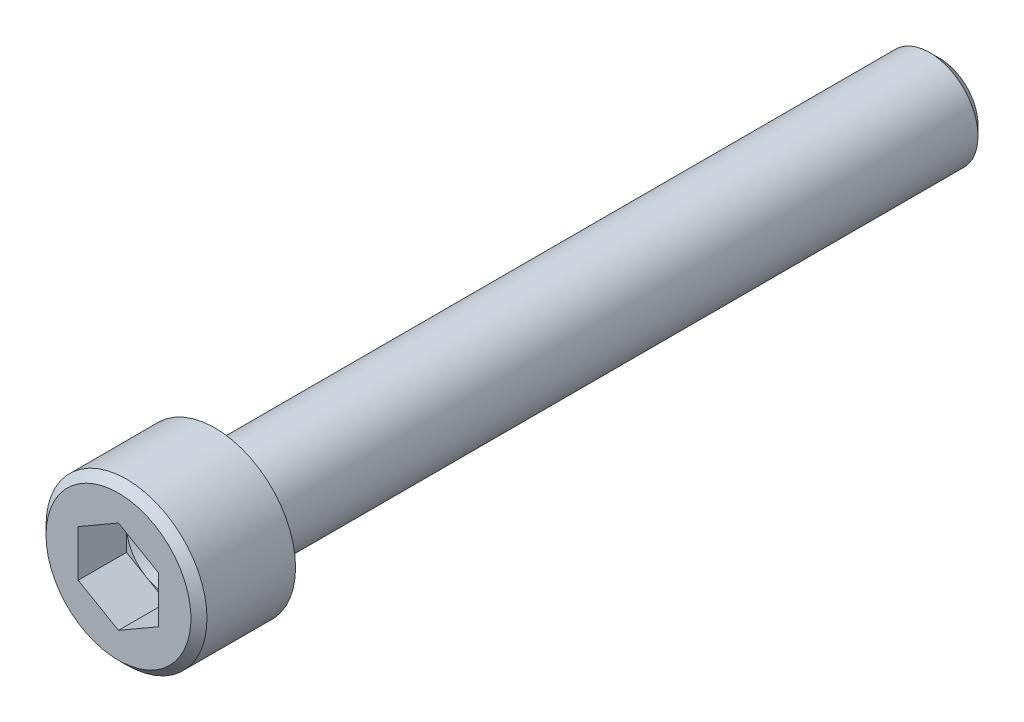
ISO-10303-21;
HEADER;
FILE_DESCRIPTION(('STEP AP214'),'2;1');
FILE_NAME('part.step','',(''),(''),'','','');
FILE_SCHEMA(('AUTOMOTIVE_DESIGN { 1 0 10303 214 1 1 1 1 }'));
ENDSEC;
DATA;
#1=APPLICATION_CONTEXT('core data for automotive mechanical design processes');
#2=APPLICATION_PROTOCOL_DEFINITION('international standard','automotive_design',2000,#1);
#3=PRODUCT_CONTEXT('',#1,'mechanical');
#4=PRODUCT('Part','Part','',(#3));
#5=PRODUCT_RELATED_PRODUCT_CATEGORY('part','',(#4));
#6=PRODUCT_DEFINITION_FORMATION('','',#4);
#7=PRODUCT_DEFINITION_CONTEXT('part definition',#1,'design');
#8=PRODUCT_DEFINITION('design','',#6,#7);
#9=PRODUCT_DEFINITION_SHAPE('','',#8);
#10=(LENGTH_UNIT() NAMED_UNIT(*) SI_UNIT(.MILLI.,.METRE.));
#11=(NAMED_UNIT(*) PLANE_ANGLE_UNIT() SI_UNIT($,.RADIAN.));
#12=(NAMED_UNIT(*) SI_UNIT($,.STERADIAN.) SOLID_ANGLE_UNIT());
#13=UNCERTAINTY_MEASURE_WITH_UNIT(LENGTH_MEASURE(1.E-05),#10,'distance_accuracy_value','');
#14=(GEOMETRIC_REPRESENTATION_CONTEXT(3) GLOBAL_UNCERTAINTY_ASSIGNED_CONTEXT((#13)) GLOBAL_UNIT_ASSIGNED_CONTEXT((#10,
#11,#12)) REPRESENTATION_CONTEXT('',''));
#15=CARTESIAN_POINT('',(0.,0.,0.));
#16=DIRECTION('',(0.,0.,1.));
#17=DIRECTION('',(1.,0.,0.));
#18=AXIS2_PLACEMENT_3D('',#15,#16,#17);
#19=CARTESIAN_POINT('',(0.,0.,3.));
#20=DIRECTION('',(0.,0.,1.));
#21=DIRECTION('',(1.,0.,0.));
#22=AXIS2_PLACEMENT_3D('',#19,#20,#21);
#23=PLANE('',#22);
#24=CARTESIAN_POINT('',(0.,0.,2.99999999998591));
#25=DIRECTION('',(0.,0.,1.));
#26=DIRECTION('',(1.,0.,0.));
#27=AXIS2_PLACEMENT_3D('',#24,#25,#26);
#28=CIRCLE('',#27,2.49999999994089);
#29=CARTESIAN_POINT('',(2.49999999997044,0.,2.99999999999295));
#30=VERTEX_POINT('',#29);
#31=CARTESIAN_POINT('',(1.24999999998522,-2.1650635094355,2.99999999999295));
#32=VERTEX_POINT('',#31);
#33=EDGE_CURVE('E19',#30,#32,#28,.F.);
#34=ORIENTED_EDGE('',*,*,#33,.T.);
#35=DIRECTION('',(0.866025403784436,0.5,0.));
#36=VECTOR('',#35,1.);
#37=CARTESIAN_POINT('',(1.25,-2.1650635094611,3.));
#38=LINE('',#37,#36);
#39=CARTESIAN_POINT('',(2.5,-1.44337567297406,3.));
#40=VERTEX_POINT('',#39);
#41=EDGE_CURVE('E92',#32,#40,#38,.T.);
#42=ORIENTED_EDGE('',*,*,#41,.T.);
#43=DIRECTION('',(0.,1.,0.));
#44=VECTOR('',#43,1.);
#45=CARTESIAN_POINT('',(2.5,0.,3.));
#46=LINE('',#45,#44);
#47=EDGE_CURVE('E88',#40,#30,#46,.T.);
#48=ORIENTED_EDGE('',*,*,#47,.T.);
#49=EDGE_LOOP('',(#34,#42,#48));
#50=FACE_BOUND('',#49,.T.);
#51=ADVANCED_FACE('F16',(#50),#23,.T.);
#52=CARTESIAN_POINT('',(0.,0.,3.));
#53=DIRECTION('',(0.,0.,1.));
#54=DIRECTION('',(1.,0.,0.));
#55=AXIS2_PLACEMENT_3D('',#52,#53,#54);
#56=PLANE('',#55);
#57=CARTESIAN_POINT('',(0.,0.,2.99999999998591));
#58=DIRECTION('',(0.,0.,1.));
#59=DIRECTION('',(1.,0.,0.));
#60=AXIS2_PLACEMENT_3D('',#57,#58,#59);
#61=CIRCLE('',#60,2.49999999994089);
#62=CARTESIAN_POINT('',(-1.24999999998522,-2.1650635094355,2.99999999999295));
#63=VERTEX_POINT('',#62);
#64=EDGE_CURVE('E107',#32,#63,#61,.F.);
#65=ORIENTED_EDGE('',*,*,#64,.T.);
#66=DIRECTION('',(0.866025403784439,-0.5,0.));
#67=VECTOR('',#66,1.);
#68=CARTESIAN_POINT('',(-1.25,-2.1650635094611,3.));
#69=LINE('',#68,#67);
#70=CARTESIAN_POINT('',(0.,-2.88675134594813,3.));
#71=VERTEX_POINT('',#70);
#72=EDGE_CURVE('E157',#63,#71,#69,.T.);
#73=ORIENTED_EDGE('',*,*,#72,.T.);
#74=DIRECTION('',(0.866025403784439,0.5,0.));
#75=VECTOR('',#74,1.);
#76=CARTESIAN_POINT('',(0.,-2.88675134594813,3.));
#77=LINE('',#76,#75);
#78=EDGE_CURVE('E162',#71,#32,#77,.T.);
#79=ORIENTED_EDGE('',*,*,#78,.T.);
#80=EDGE_LOOP('',(#65,#73,#79));
#81=FACE_BOUND('',#80,.T.);
#82=ADVANCED_FACE('F216',(#81),#56,.T.);
#83=CARTESIAN_POINT('',(0.,0.,3.));
#84=DIRECTION('',(0.,0.,1.));
#85=DIRECTION('',(1.,0.,0.));
#86=AXIS2_PLACEMENT_3D('',#83,#84,#85);
#87=PLANE('',#86);
#88=CARTESIAN_POINT('',(0.,0.,2.99999999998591));
#89=DIRECTION('',(0.,0.,1.));
#90=DIRECTION('',(1.,0.,0.));
#91=AXIS2_PLACEMENT_3D('',#88,#89,#90);
#92=CIRCLE('',#91,2.49999999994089);
#93=CARTESIAN_POINT('',(-2.49999999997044,0.,2.99999999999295));
#94=VERTEX_POINT('',#93);
#95=EDGE_CURVE('E213',#63,#94,#92,.F.);
#96=ORIENTED_EDGE('',*,*,#95,.T.);
#97=DIRECTION('',(0.,1.,0.));
#98=VECTOR('',#97,1.);
#99=CARTESIAN_POINT('',(-2.5,0.,3.));
#100=LINE('',#99,#98);
#101=CARTESIAN_POINT('',(-2.5,-1.44337567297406,3.));
#102=VERTEX_POINT('',#101);
#103=EDGE_CURVE('E147',#94,#102,#100,.F.);
#104=ORIENTED_EDGE('',*,*,#103,.T.);
#105=DIRECTION('',(0.866025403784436,-0.5,0.));
#106=VECTOR('',#105,1.);
#107=CARTESIAN_POINT('',(-2.5,-1.44337567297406,3.));
#108=LINE('',#107,#106);
#109=EDGE_CURVE('E152',#102,#63,#108,.T.);
#110=ORIENTED_EDGE('',*,*,#109,.T.);
#111=EDGE_LOOP('',(#96,#104,#110));
#112=FACE_BOUND('',#111,.T.);
#113=ADVANCED_FACE('F218',(#112),#87,.T.);
#114=CARTESIAN_POINT('',(0.,0.,3.));
#115=DIRECTION('',(0.,0.,1.));
#116=DIRECTION('',(1.,0.,0.));
#117=AXIS2_PLACEMENT_3D('',#114,#115,#116);
#118=PLANE('',#117);
#119=CARTESIAN_POINT('',(0.,0.,2.99999999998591));
#120=DIRECTION('',(0.,0.,1.));
#121=DIRECTION('',(1.,0.,0.));
#122=AXIS2_PLACEMENT_3D('',#119,#120,#121);
#123=CIRCLE('',#122,2.49999999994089);
#124=CARTESIAN_POINT('',(-1.24999999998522,2.1650635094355,2.99999999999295));
#125=VERTEX_POINT('',#124);
#126=EDGE_CURVE('E210',#94,#125,#123,.F.);
#127=ORIENTED_EDGE('',*,*,#126,.T.);
#128=DIRECTION('',(-0.866025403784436,-0.5,0.));
#129=VECTOR('',#128,1.);
#130=CARTESIAN_POINT('',(-1.25,2.1650635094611,3.));
#131=LINE('',#130,#129);
#132=CARTESIAN_POINT('',(-2.5,1.44337567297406,3.));
#133=VERTEX_POINT('',#132);
#134=EDGE_CURVE('E137',#125,#133,#131,.T.);
#135=ORIENTED_EDGE('',*,*,#134,.T.);
#136=DIRECTION('',(0.,1.,0.));
#137=VECTOR('',#136,1.);
#138=CARTESIAN_POINT('',(-2.5,0.,3.));
#139=LINE('',#138,#137);
#140=EDGE_CURVE('E142',#133,#94,#139,.F.);
#141=ORIENTED_EDGE('',*,*,#140,.T.);
#142=EDGE_LOOP('',(#127,#135,#141));
#143=FACE_BOUND('',#142,.T.);
#144=ADVANCED_FACE('F221',(#143),#118,.T.);
#145=CARTESIAN_POINT('',(0.,0.,3.));
#146=DIRECTION('',(0.,0.,1.));
#147=DIRECTION('',(1.,0.,0.));
#148=AXIS2_PLACEMENT_3D('',#145,#146,#147);
#149=PLANE('',#148);
#150=CARTESIAN_POINT('',(0.,0.,2.99999999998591));
#151=DIRECTION('',(0.,0.,1.));
#152=DIRECTION('',(1.,0.,0.));
#153=AXIS2_PLACEMENT_3D('',#150,#151,#152);
#154=CIRCLE('',#153,2.49999999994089);
#155=CARTESIAN_POINT('',(1.24999999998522,2.1650635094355,2.99999999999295));
#156=VERTEX_POINT('',#155);
#157=EDGE_CURVE('E207',#125,#156,#154,.F.);
#158=ORIENTED_EDGE('',*,*,#157,.T.);
#159=DIRECTION('',(-0.866025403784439,0.5,0.));
#160=VECTOR('',#159,1.);
#161=CARTESIAN_POINT('',(1.25,2.1650635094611,3.));
#162=LINE('',#161,#160);
#163=CARTESIAN_POINT('',(0.,2.88675134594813,3.));
#164=VERTEX_POINT('',#163);
#165=EDGE_CURVE('E108',#156,#164,#162,.T.);
#166=ORIENTED_EDGE('',*,*,#165,.T.);
#167=DIRECTION('',(-0.866025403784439,-0.5,0.));
#168=VECTOR('',#167,1.);
#169=CARTESIAN_POINT('',(0.,2.88675134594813,3.));
#170=LINE('',#169,#168);
#171=EDGE_CURVE('E132',#164,#125,#170,.T.);
#172=ORIENTED_EDGE('',*,*,#171,.T.);
#173=EDGE_LOOP('',(#158,#166,#172));
#174=FACE_BOUND('',#173,.T.);
#175=ADVANCED_FACE('F223',(#174),#149,.T.);
#176=CARTESIAN_POINT('',(0.,0.,2.99999999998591));
#177=DIRECTION('',(0.,0.,1.));
#178=DIRECTION('',(1.,0.,0.));
#179=AXIS2_PLACEMENT_3D('',#176,#177,#178);
#180=CONICAL_SURFACE('',#179,2.49999999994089,1.04719755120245);
#181=CARTESIAN_POINT('',(0.,0.,1.55662432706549));
#182=VERTEX_POINT('',#181);
#183=VERTEX_LOOP('',#182);
#184=FACE_BOUND('',#183,.T.);
#185=ORIENTED_EDGE('',*,*,#157,.F.);
#186=ORIENTED_EDGE('',*,*,#126,.F.);
#187=ORIENTED_EDGE('',*,*,#95,.F.);
#188=ORIENTED_EDGE('',*,*,#64,.F.);
#189=ORIENTED_EDGE('',*,*,#33,.F.);
#190=CARTESIAN_POINT('',(0.,0.,2.99999999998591));
#191=DIRECTION('',(0.,0.,1.));
#192=DIRECTION('',(1.,0.,0.));
#193=AXIS2_PLACEMENT_3D('',#190,#191,#192);
#194=CIRCLE('',#193,2.49999999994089);
#195=EDGE_CURVE('E103',#156,#30,#194,.F.);
#196=ORIENTED_EDGE('',*,*,#195,.F.);
#197=EDGE_LOOP('',(#185,#186,#187,#188,#189,#196));
#198=FACE_BOUND('',#197,.T.);
#199=ADVANCED_FACE('F102',(#184,#198),#180,.F.);
#200=CARTESIAN_POINT('',(0.,0.,3.));
#201=DIRECTION('',(0.,0.,1.));
#202=DIRECTION('',(1.,0.,0.));
#203=AXIS2_PLACEMENT_3D('',#200,#201,#202);
#204=PLANE('',#203);
#205=ORIENTED_EDGE('',*,*,#195,.T.);
#206=DIRECTION('',(0.,1.,0.));
#207=VECTOR('',#206,1.);
#208=CARTESIAN_POINT('',(2.5,-1.44337567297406,3.));
#209=LINE('',#208,#207);
#210=CARTESIAN_POINT('',(2.5,1.44337567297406,3.));
#211=VERTEX_POINT('',#210);
#212=EDGE_CURVE('E112',#30,#211,#209,.T.);
#213=ORIENTED_EDGE('',*,*,#212,.T.);
#214=DIRECTION('',(-0.866025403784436,0.5,0.));
#215=VECTOR('',#214,1.);
#216=CARTESIAN_POINT('',(2.5,1.44337567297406,3.));
#217=LINE('',#216,#215);
#218=EDGE_CURVE('E114',#211,#156,#217,.T.);
#219=ORIENTED_EDGE('',*,*,#218,.T.);
#220=EDGE_LOOP('',(#205,#213,#219));
#221=FACE_BOUND('',#220,.T.);
#222=ADVANCED_FACE('F111',(#221),#204,.T.);
#223=CARTESIAN_POINT('',(2.5,-1.44337567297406,3.));
#224=DIRECTION('',(1.,0.,0.));
#225=DIRECTION('',(0.,0.,-1.));
#226=AXIS2_PLACEMENT_3D('',#223,#224,#225);
#227=PLANE('',#226);
#228=DIRECTION('',(0.,0.,1.));
#229=VECTOR('',#228,1.);
#230=CARTESIAN_POINT('',(2.5,1.44337567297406,3.));
#231=LINE('',#230,#229);
#232=CARTESIAN_POINT('',(2.5,1.44337567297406,6.));
#233=VERTEX_POINT('',#232);
#234=EDGE_CURVE('E118',#233,#211,#231,.F.);
#235=ORIENTED_EDGE('',*,*,#234,.T.);
#236=ORIENTED_EDGE('',*,*,#212,.F.);
#237=ORIENTED_EDGE('',*,*,#47,.F.);
#238=DIRECTION('',(0.,0.,1.));
#239=VECTOR('',#238,1.);
#240=CARTESIAN_POINT('',(2.5,-1.44337567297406,3.));
#241=LINE('',#240,#239);
#242=CARTESIAN_POINT('',(2.5,-1.44337567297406,6.));
#243=VERTEX_POINT('',#242);
#244=EDGE_CURVE('E189',#40,#243,#241,.T.);
#245=ORIENTED_EDGE('',*,*,#244,.T.);
#246=DIRECTION('',(0.,1.,0.));
#247=VECTOR('',#246,1.);
#248=CARTESIAN_POINT('',(2.5,0.,6.));
#249=LINE('',#248,#247);
#250=EDGE_CURVE('E193',#243,#233,#249,.T.);
#251=ORIENTED_EDGE('',*,*,#250,.T.);
#252=EDGE_LOOP('',(#235,#236,#237,#245,#251));
#253=FACE_BOUND('',#252,.T.);
#254=ADVANCED_FACE('F116',(#253),#227,.F.);
#255=CARTESIAN_POINT('',(2.5,1.44337567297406,3.));
#256=DIRECTION('',(0.5,0.866025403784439,0.));
#257=DIRECTION('',(-0.866025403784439,0.5,0.));
#258=AXIS2_PLACEMENT_3D('',#255,#256,#257);
#259=PLANE('',#258);
#260=DIRECTION('',(0.,0.,1.));
#261=VECTOR('',#260,1.);
#262=CARTESIAN_POINT('',(0.,2.88675134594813,3.));
#263=LINE('',#262,#261);
#264=CARTESIAN_POINT('',(0.,2.88675134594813,6.));
#265=VERTEX_POINT('',#264);
#266=EDGE_CURVE('E120',#265,#164,#263,.F.);
#267=ORIENTED_EDGE('',*,*,#266,.T.);
#268=ORIENTED_EDGE('',*,*,#165,.F.);
#269=ORIENTED_EDGE('',*,*,#218,.F.);
#270=ORIENTED_EDGE('',*,*,#234,.F.);
#271=DIRECTION('',(-0.866025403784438,0.5,0.));
#272=VECTOR('',#271,1.);
#273=CARTESIAN_POINT('',(2.5,1.44337567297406,6.));
#274=LINE('',#273,#272);
#275=EDGE_CURVE('E231',#233,#265,#274,.T.);
#276=ORIENTED_EDGE('',*,*,#275,.T.);
#277=EDGE_LOOP('',(#267,#268,#269,#270,#276));
#278=FACE_BOUND('',#277,.T.);
#279=ADVANCED_FACE('F229',(#278),#259,.F.);
#280=CARTESIAN_POINT('',(0.,2.88675134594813,3.));
#281=DIRECTION('',(-0.5,0.866025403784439,0.));
#282=DIRECTION('',(-0.866025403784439,-0.5,0.));
#283=AXIS2_PLACEMENT_3D('',#280,#281,#282);
#284=PLANE('',#283);
#285=DIRECTION('',(0.,0.,1.));
#286=VECTOR('',#285,1.);
#287=CARTESIAN_POINT('',(-2.5,1.44337567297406,3.));
#288=LINE('',#287,#286);
#289=CARTESIAN_POINT('',(-2.5,1.44337567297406,6.));
#290=VERTEX_POINT('',#289);
#291=EDGE_CURVE('E175',#290,#133,#288,.F.);
#292=ORIENTED_EDGE('',*,*,#291,.T.);
#293=ORIENTED_EDGE('',*,*,#134,.F.);
#294=ORIENTED_EDGE('',*,*,#171,.F.);
#295=ORIENTED_EDGE('',*,*,#266,.F.);
#296=DIRECTION('',(-0.866025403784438,-0.5,0.));
#297=VECTOR('',#296,1.);
#298=CARTESIAN_POINT('',(0.,2.88675134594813,6.));
#299=LINE('',#298,#297);
#300=EDGE_CURVE('E234',#265,#290,#299,.T.);
#301=ORIENTED_EDGE('',*,*,#300,.T.);
#302=EDGE_LOOP('',(#292,#293,#294,#295,#301));
#303=FACE_BOUND('',#302,.T.);
#304=ADVANCED_FACE('F226',(#303),#284,.F.);
#305=CARTESIAN_POINT('',(-2.5,1.44337567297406,3.));
#306=DIRECTION('',(-1.,0.,0.));
#307=DIRECTION('',(0.,0.,1.));
#308=AXIS2_PLACEMENT_3D('',#305,#306,#307);
#309=PLANE('',#308);
#310=DIRECTION('',(0.,0.,1.));
#311=VECTOR('',#310,1.);
#312=CARTESIAN_POINT('',(-2.5,-1.44337567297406,3.));
#313=LINE('',#312,#311);
#314=CARTESIAN_POINT('',(-2.5,-1.44337567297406,6.));
#315=VERTEX_POINT('',#314);
#316=EDGE_CURVE('E180',#315,#102,#313,.F.);
#317=ORIENTED_EDGE('',*,*,#316,.T.);
#318=ORIENTED_EDGE('',*,*,#103,.F.);
#319=ORIENTED_EDGE('',*,*,#140,.F.);
#320=ORIENTED_EDGE('',*,*,#291,.F.);
#321=DIRECTION('',(0.,1.,0.));
#322=VECTOR('',#321,1.);
#323=CARTESIAN_POINT('',(-2.5,0.,6.));
#324=LINE('',#323,#322);
#325=EDGE_CURVE('E236',#290,#315,#324,.F.);
#326=ORIENTED_EDGE('',*,*,#325,.T.);
#327=EDGE_LOOP('',(#317,#318,#319,#320,#326));
#328=FACE_BOUND('',#327,.T.);
#329=ADVANCED_FACE('F349',(#328),#309,.F.);
#330=CARTESIAN_POINT('',(-2.5,-1.44337567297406,3.));
#331=DIRECTION('',(-0.5,-0.866025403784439,0.));
#332=DIRECTION('',(0.866025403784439,-0.5,0.));
#333=AXIS2_PLACEMENT_3D('',#330,#331,#332);
#334=PLANE('',#333);
#335=DIRECTION('',(0.,0.,1.));
#336=VECTOR('',#335,1.);
#337=CARTESIAN_POINT('',(0.,-2.88675134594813,3.));
#338=LINE('',#337,#336);
#339=CARTESIAN_POINT('',(0.,-2.88675134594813,6.));
#340=VERTEX_POINT('',#339);
#341=EDGE_CURVE('E185',#340,#71,#338,.F.);
#342=ORIENTED_EDGE('',*,*,#341,.T.);
#343=ORIENTED_EDGE('',*,*,#72,.F.);
#344=ORIENTED_EDGE('',*,*,#109,.F.);
#345=ORIENTED_EDGE('',*,*,#316,.F.);
#346=DIRECTION('',(0.866025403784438,-0.5,0.));
#347=VECTOR('',#346,1.);
#348=CARTESIAN_POINT('',(-2.5,-1.44337567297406,6.));
#349=LINE('',#348,#347);
#350=EDGE_CURVE('E34',#315,#340,#349,.T.);
#351=ORIENTED_EDGE('',*,*,#350,.T.);
#352=EDGE_LOOP('',(#342,#343,#344,#345,#351));
#353=FACE_BOUND('',#352,.T.);
#354=ADVANCED_FACE('F340',(#353),#334,.F.);
#355=CARTESIAN_POINT('',(0.,-2.88675134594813,3.));
#356=DIRECTION('',(0.5,-0.866025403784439,0.));
#357=DIRECTION('',(0.866025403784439,0.5,0.));
#358=AXIS2_PLACEMENT_3D('',#355,#356,#357);
#359=PLANE('',#358);
#360=ORIENTED_EDGE('',*,*,#244,.F.);
#361=ORIENTED_EDGE('',*,*,#41,.F.);
#362=ORIENTED_EDGE('',*,*,#78,.F.);
#363=ORIENTED_EDGE('',*,*,#341,.F.);
#364=DIRECTION('',(0.866025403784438,0.5,0.));
#365=VECTOR('',#364,1.);
#366=CARTESIAN_POINT('',(0.,-2.88675134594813,6.));
#367=LINE('',#366,#365);
#368=EDGE_CURVE('E205',#340,#243,#367,.T.);
#369=ORIENTED_EDGE('',*,*,#368,.T.);
#370=EDGE_LOOP('',(#360,#361,#362,#363,#369));
#371=FACE_BOUND('',#370,.T.);
#372=ADVANCED_FACE('F333',(#371),#359,.F.);
#373=CARTESIAN_POINT('',(0.,0.,6.));
#374=DIRECTION('',(0.,0.,-1.));
#375=DIRECTION('',(-1.,0.,0.));
#376=AXIS2_PLACEMENT_3D('',#373,#374,#375);
#377=PLANE('',#376);
#378=ORIENTED_EDGE('',*,*,#350,.F.);
#379=ORIENTED_EDGE('',*,*,#325,.F.);
#380=ORIENTED_EDGE('',*,*,#300,.F.);
#381=ORIENTED_EDGE('',*,*,#275,.F.);
#382=ORIENTED_EDGE('',*,*,#250,.F.);
#383=ORIENTED_EDGE('',*,*,#368,.F.);
#384=EDGE_LOOP('',(#378,#379,#380,#381,#382,#383));
#385=FACE_BOUND('',#384,.T.);
#386=CARTESIAN_POINT('',(0.,0.,5.99999999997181));
#387=DIRECTION('',(0.,0.,-1.));
#388=DIRECTION('',(-1.,0.,0.));
#389=AXIS2_PLACEMENT_3D('',#386,#387,#388);
#390=CIRCLE('',#389,4.49999999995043);
#391=CARTESIAN_POINT('',(-4.49999999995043,0.,5.99999999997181));
#392=VERTEX_POINT('',#391);
#393=EDGE_CURVE('E203',#392,#392,#390,.T.);
#394=ORIENTED_EDGE('',*,*,#393,.F.);
#395=EDGE_LOOP('',(#394));
#396=FACE_BOUND('',#395,.T.);
#397=ADVANCED_FACE('F275',(#385,#396),#377,.F.);
#398=CARTESIAN_POINT('',(0.,0.,5.49999999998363));
#399=DIRECTION('',(0.,0.,-1.));
#400=DIRECTION('',(-1.,0.,0.));
#401=AXIS2_PLACEMENT_3D('',#398,#399,#400);
#402=CONICAL_SURFACE('',#401,4.99999999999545,0.785398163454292);
#403=ORIENTED_EDGE('',*,*,#393,.T.);
#404=EDGE_LOOP('',(#403));
#405=FACE_BOUND('',#404,.T.);
#406=CARTESIAN_POINT('',(0.,0.,5.5));
#407=DIRECTION('',(0.,0.,1.));
#408=DIRECTION('',(1.,0.,0.));
#409=AXIS2_PLACEMENT_3D('',#406,#407,#408);
#410=CIRCLE('',#409,5.);
#411=CARTESIAN_POINT('',(5.,0.,5.5));
#412=VERTEX_POINT('',#411);
#413=EDGE_CURVE('E202',#412,#412,#410,.F.);
#414=ORIENTED_EDGE('',*,*,#413,.F.);
#415=EDGE_LOOP('',(#414));
#416=FACE_BOUND('',#415,.T.);
#417=ADVANCED_FACE('F265',(#405,#416),#402,.T.);
#418=CARTESIAN_POINT('',(0.,2.3865,-45.));
#419=DIRECTION('',(0.,0.,1.));
#420=DIRECTION('',(1.,0.,0.));
#421=AXIS2_PLACEMENT_3D('',#418,#419,#420);
#422=PLANE('',#421);
#423=CARTESIAN_POINT('',(0.,0.,-44.9999999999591));
#424=DIRECTION('',(0.,0.,1.));
#425=DIRECTION('',(1.,0.,0.));
#426=AXIS2_PLACEMENT_3D('',#423,#424,#425);
#427=CIRCLE('',#426,2.38650000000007);
#428=CARTESIAN_POINT('',(2.38650000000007,0.,-44.9999999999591));
#429=VERTEX_POINT('',#428);
#430=EDGE_CURVE('E199',#429,#429,#427,.T.);
#431=ORIENTED_EDGE('',*,*,#430,.F.);
#432=EDGE_LOOP('',(#431));
#433=FACE_BOUND('',#432,.T.);
#434=ADVANCED_FACE('F263',(#433),#422,.F.);
#435=CARTESIAN_POINT('',(0.,0.,0.));
#436=DIRECTION('',(0.,0.,1.));
#437=DIRECTION('',(1.,0.,0.));
#438=AXIS2_PLACEMENT_3D('',#435,#436,#437);
#439=CYLINDRICAL_SURFACE('',#438,5.);
#440=ORIENTED_EDGE('',*,*,#413,.T.);
#441=EDGE_LOOP('',(#440));
#442=FACE_BOUND('',#441,.T.);
#443=CARTESIAN_POINT('',(0.,0.,0.));
#444=DIRECTION('',(0.,0.,1.));
#445=DIRECTION('',(1.,0.,0.));
#446=AXIS2_PLACEMENT_3D('',#443,#444,#445);
#447=CIRCLE('',#446,5.);
#448=CARTESIAN_POINT('',(5.,0.,0.));
#449=VERTEX_POINT('',#448);
#450=EDGE_CURVE('E196',#449,#449,#447,.T.);
#451=ORIENTED_EDGE('',*,*,#450,.T.);
#452=EDGE_LOOP('',(#451));
#453=FACE_BOUND('',#452,.T.);
#454=ADVANCED_FACE('F259',(#442,#453),#439,.T.);
#455=CARTESIAN_POINT('',(0.,0.,-44.386500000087));
#456=DIRECTION('',(0.,0.,1.));
#457=DIRECTION('',(1.,0.,0.));
#458=AXIS2_PLACEMENT_3D('',#455,#456,#457);
#459=CONICAL_SURFACE('',#458,2.99999999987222,0.785398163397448);
#460=CARTESIAN_POINT('',(0.,0.,-44.3865));
#461=DIRECTION('',(0.,0.,1.));
#462=DIRECTION('',(1.,0.,0.));
#463=AXIS2_PLACEMENT_3D('',#460,#461,#462);
#464=CIRCLE('',#463,3.);
#465=CARTESIAN_POINT('',(3.,0.,-44.3865));
#466=VERTEX_POINT('',#465);
#467=EDGE_CURVE('E25',#466,#466,#464,.T.);
#468=ORIENTED_EDGE('',*,*,#467,.F.);
#469=EDGE_LOOP('',(#468));
#470=FACE_BOUND('',#469,.T.);
#471=ORIENTED_EDGE('',*,*,#430,.T.);
#472=EDGE_LOOP('',(#471));
#473=FACE_BOUND('',#472,.T.);
#474=ADVANCED_FACE('F255',(#470,#473),#459,.T.);
#475=CARTESIAN_POINT('',(0.,5.,0.));
#476=DIRECTION('',(0.,0.,1.));
#477=DIRECTION('',(1.,0.,0.));
#478=AXIS2_PLACEMENT_3D('',#475,#476,#477);
#479=PLANE('',#478);
#480=ORIENTED_EDGE('',*,*,#450,.F.);
#481=EDGE_LOOP('',(#480));
#482=FACE_BOUND('',#481,.T.);
#483=CARTESIAN_POINT('',(0.,0.,0.));
#484=DIRECTION('',(0.,0.,1.));
#485=DIRECTION('',(1.,0.,0.));
#486=AXIS2_PLACEMENT_3D('',#483,#484,#485);
#487=CIRCLE('',#486,3.);
#488=CARTESIAN_POINT('',(3.,0.,0.));
#489=VERTEX_POINT('',#488);
#490=EDGE_CURVE('E11',#489,#489,#487,.F.);
#491=ORIENTED_EDGE('',*,*,#490,.F.);
#492=EDGE_LOOP('',(#491));
#493=FACE_BOUND('',#492,.T.);
#494=ADVANCED_FACE('F258',(#482,#493),#479,.F.);
#495=CARTESIAN_POINT('',(0.,0.,-45.));
#496=DIRECTION('',(0.,0.,1.));
#497=DIRECTION('',(1.,0.,0.));
#498=AXIS2_PLACEMENT_3D('',#495,#496,#497);
#499=CYLINDRICAL_SURFACE('',#498,3.);
#500=ORIENTED_EDGE('',*,*,#490,.T.);
#501=EDGE_LOOP('',(#500));
#502=FACE_BOUND('',#501,.T.);
#503=ORIENTED_EDGE('',*,*,#467,.T.);
#504=EDGE_LOOP('',(#503));
#505=FACE_BOUND('',#504,.T.);
#506=ADVANCED_FACE('F253',(#502,#505),#499,.T.);
#507=CLOSED_SHELL('',(#51,#82,#113,#144,#175,#199,#222,#254,#279,#304,#329,#354,#372,#397,#417,
#434,#454,#474,#494,#506));
#508=MANIFOLD_SOLID_BREP('B1',#507);
#509=ADVANCED_BREP_SHAPE_REPRESENTATION('',(#18,#508),#14);
#510=SHAPE_DEFINITION_REPRESENTATION(#9,#509);
ENDSEC;
END-ISO-10303-21;
